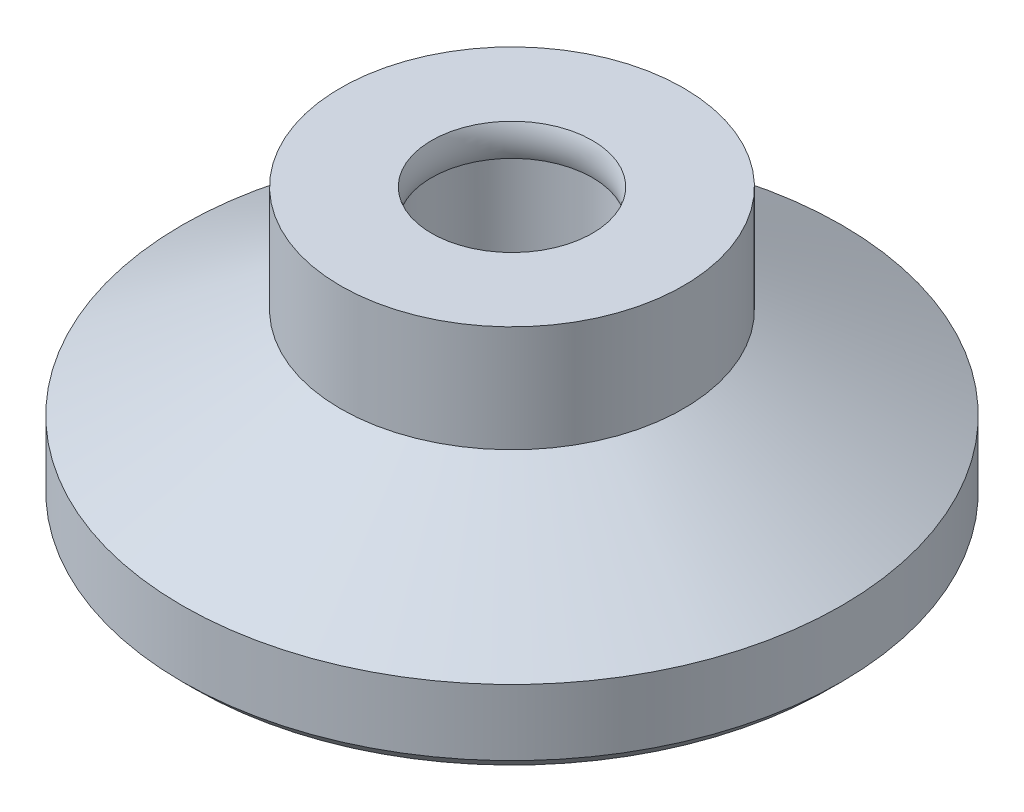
ISO-10303-21;
HEADER;
FILE_DESCRIPTION(('STEP AP214'),'2;1');
FILE_NAME('part.step','',(''),(''),'','','');
FILE_SCHEMA(('AUTOMOTIVE_DESIGN { 1 0 10303 214 1 1 1 1 }'));
ENDSEC;
DATA;
#1=APPLICATION_CONTEXT('core data for automotive mechanical design processes');
#2=APPLICATION_PROTOCOL_DEFINITION('international standard','automotive_design',2000,#1);
#3=PRODUCT_CONTEXT('',#1,'mechanical');
#4=PRODUCT('Part','Part','',(#3));
#5=PRODUCT_RELATED_PRODUCT_CATEGORY('part','',(#4));
#6=PRODUCT_DEFINITION_FORMATION('','',#4);
#7=PRODUCT_DEFINITION_CONTEXT('part definition',#1,'design');
#8=PRODUCT_DEFINITION('design','',#6,#7);
#9=PRODUCT_DEFINITION_SHAPE('','',#8);
#10=(LENGTH_UNIT() NAMED_UNIT(*) SI_UNIT(.MILLI.,.METRE.));
#11=(NAMED_UNIT(*) PLANE_ANGLE_UNIT() SI_UNIT($,.RADIAN.));
#12=(NAMED_UNIT(*) SI_UNIT($,.STERADIAN.) SOLID_ANGLE_UNIT());
#13=UNCERTAINTY_MEASURE_WITH_UNIT(LENGTH_MEASURE(1.E-05),#10,'distance_accuracy_value','');
#14=(GEOMETRIC_REPRESENTATION_CONTEXT(3) GLOBAL_UNCERTAINTY_ASSIGNED_CONTEXT((#13)) GLOBAL_UNIT_ASSIGNED_CONTEXT((#10,
#11,#12)) REPRESENTATION_CONTEXT('',''));
#15=CARTESIAN_POINT('',(0.,0.,0.));
#16=DIRECTION('',(0.,0.,1.));
#17=DIRECTION('',(1.,0.,0.));
#18=AXIS2_PLACEMENT_3D('',#15,#16,#17);
#19=CARTESIAN_POINT('',(0.,5.25,0.));
#20=DIRECTION('',(0.,-1.,0.));
#21=DIRECTION('',(0.,0.,-1.));
#22=AXIS2_PLACEMENT_3D('',#19,#20,#21);
#23=CYLINDRICAL_SURFACE('',#22,6.5);
#24=CARTESIAN_POINT('',(0.,1.21410161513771,0.));
#25=DIRECTION('',(0.,1.,0.));
#26=DIRECTION('',(0.,0.,1.));
#27=AXIS2_PLACEMENT_3D('',#24,#25,#26);
#28=CIRCLE('',#27,6.5);
#29=CARTESIAN_POINT('',(0.,1.21410161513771,-6.5));
#30=VERTEX_POINT('',#29);
#31=EDGE_CURVE('E91',#30,#30,#28,.T.);
#32=CARTESIAN_POINT('',(0.,5.25,0.));
#33=DIRECTION('',(0.,1.,0.));
#34=DIRECTION('',(0.,0.,1.));
#35=AXIS2_PLACEMENT_3D('',#32,#33,#34);
#36=CIRCLE('',#35,6.5);
#37=CARTESIAN_POINT('',(0.,5.25,-6.5));
#38=VERTEX_POINT('',#37);
#39=EDGE_CURVE('E93',#38,#38,#36,.T.);
#40=CARTESIAN_POINT('',(0.,1.21410161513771,-6.5));
#41=CARTESIAN_POINT('',(0.,1.25614222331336,-6.5));
#42=CARTESIAN_POINT('',(0.,1.29818283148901,-6.5));
#43=CARTESIAN_POINT('',(0.,1.3822640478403,-6.5));
#44=CARTESIAN_POINT('',(0.,1.42430465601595,-6.5));
#45=CARTESIAN_POINT('',(0.,1.50838587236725,-6.5));
#46=CARTESIAN_POINT('',(0.,1.5504264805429,-6.5));
#47=CARTESIAN_POINT('',(0.,1.6345076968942,-6.5));
#48=CARTESIAN_POINT('',(0.,1.67654830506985,-6.5));
#49=CARTESIAN_POINT('',(0.,1.76062952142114,-6.5));
#50=CARTESIAN_POINT('',(0.,1.80267012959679,-6.5));
#51=CARTESIAN_POINT('',(0.,1.88675134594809,-6.5));
#52=CARTESIAN_POINT('',(0.,1.92879195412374,-6.5));
#53=CARTESIAN_POINT('',(0.,2.01287317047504,-6.5));
#54=CARTESIAN_POINT('',(0.,2.05491377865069,-6.5));
#55=CARTESIAN_POINT('',(0.,2.13899499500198,-6.5));
#56=CARTESIAN_POINT('',(0.,2.18103560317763,-6.5));
#57=CARTESIAN_POINT('',(0.,2.26511681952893,-6.5));
#58=CARTESIAN_POINT('',(0.,2.30715742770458,-6.5));
#59=CARTESIAN_POINT('',(0.,2.39123864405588,-6.5));
#60=CARTESIAN_POINT('',(0.,2.43327925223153,-6.5));
#61=CARTESIAN_POINT('',(0.,2.51736046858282,-6.5));
#62=CARTESIAN_POINT('',(0.,2.55940107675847,-6.5));
#63=CARTESIAN_POINT('',(0.,2.64348229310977,-6.5));
#64=CARTESIAN_POINT('',(0.,2.68552290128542,-6.5));
#65=CARTESIAN_POINT('',(0.,2.76960411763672,-6.5));
#66=CARTESIAN_POINT('',(0.,2.81164472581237,-6.5));
#67=CARTESIAN_POINT('',(0.,2.89572594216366,-6.5));
#68=CARTESIAN_POINT('',(0.,2.93776655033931,-6.5));
#69=CARTESIAN_POINT('',(0.,3.02184776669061,-6.5));
#70=CARTESIAN_POINT('',(0.,3.06388837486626,-6.5));
#71=CARTESIAN_POINT('',(0.,3.14796959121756,-6.5));
#72=CARTESIAN_POINT('',(0.,3.19001019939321,-6.5));
#73=CARTESIAN_POINT('',(0.,3.2740914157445,-6.5));
#74=CARTESIAN_POINT('',(0.,3.31613202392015,-6.5));
#75=CARTESIAN_POINT('',(0.,3.40021324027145,-6.5));
#76=CARTESIAN_POINT('',(0.,3.4422538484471,-6.5));
#77=CARTESIAN_POINT('',(0.,3.5263350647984,-6.5));
#78=CARTESIAN_POINT('',(0.,3.56837567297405,-6.5));
#79=CARTESIAN_POINT('',(0.,3.65245688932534,-6.5));
#80=CARTESIAN_POINT('',(0.,3.69449749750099,-6.5));
#81=CARTESIAN_POINT('',(0.,3.77857871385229,-6.5));
#82=CARTESIAN_POINT('',(0.,3.82061932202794,-6.5));
#83=CARTESIAN_POINT('',(0.,3.90470053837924,-6.5));
#84=CARTESIAN_POINT('',(0.,3.94674114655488,-6.5));
#85=CARTESIAN_POINT('',(0.,4.03082236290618,-6.5));
#86=CARTESIAN_POINT('',(0.,4.07286297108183,-6.5));
#87=CARTESIAN_POINT('',(0.,4.15694418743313,-6.5));
#88=CARTESIAN_POINT('',(0.,4.19898479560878,-6.5));
#89=CARTESIAN_POINT('',(0.,4.28306601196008,-6.5));
#90=CARTESIAN_POINT('',(0.,4.32510662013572,-6.5));
#91=CARTESIAN_POINT('',(0.,4.40918783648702,-6.5));
#92=CARTESIAN_POINT('',(0.,4.45122844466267,-6.5));
#93=CARTESIAN_POINT('',(0.,4.53530966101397,-6.5));
#94=CARTESIAN_POINT('',(0.,4.57735026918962,-6.5));
#95=CARTESIAN_POINT('',(0.,4.66143148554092,-6.5));
#96=CARTESIAN_POINT('',(0.,4.70347209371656,-6.5));
#97=CARTESIAN_POINT('',(0.,4.78755331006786,-6.5));
#98=CARTESIAN_POINT('',(0.,4.82959391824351,-6.5));
#99=CARTESIAN_POINT('',(0.,4.91367513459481,-6.5));
#100=CARTESIAN_POINT('',(0.,4.95571574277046,-6.5));
#101=CARTESIAN_POINT('',(0.,5.03979695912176,-6.5));
#102=CARTESIAN_POINT('',(0.,5.0818375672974,-6.5));
#103=CARTESIAN_POINT('',(0.,5.1659187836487,-6.5));
#104=CARTESIAN_POINT('',(0.,5.20795939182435,-6.5));
#105=CARTESIAN_POINT('',(0.,5.25,-6.5));
#106=B_SPLINE_CURVE_WITH_KNOTS('',3,(#40,#41,#42,#43,#44,#45,#46,#47,#48,#49,#50,#51,#52,#53,
#54,#55,#56,#57,#58,#59,#60,#61,#62,#63,#64,#65,#66,#67,#68,#69,#70,#71,#72,#73,#74,#75,#76,#77,
#78,#79,#80,#81,#82,#83,#84,#85,#86,#87,#88,#89,#90,#91,#92,#93,#94,#95,#96,#97,#98,#99,#100,
#101,#102,#103,#104,#105),.UNSPECIFIED.,.F.,.F.,(4,2,2,2,2,2,2,2,2,2,2,2,2,2,2,2,2,2,2,2,2,2,2,
2,2,2,2,2,2,2,2,2,4),(0.,0.126121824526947,0.252243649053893,0.378365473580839,
0.504487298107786,0.630609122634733,0.756730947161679,0.882852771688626,1.00897459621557,
1.13509642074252,1.26121824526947,1.38734006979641,1.51346189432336,1.63958371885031,
1.76570554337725,1.8918273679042,2.01794919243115,2.14407101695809,2.27019284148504,
2.39631466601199,2.52243649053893,2.64855831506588,2.77468013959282,2.90080196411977,
3.02692378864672,3.15304561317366,3.27916743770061,3.40528926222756,3.5314110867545,
3.65753291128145,3.7836547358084,3.90977656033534,4.03589838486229),.UNSPECIFIED.);
#107=EDGE_CURVE('BSEAM37',#30,#38,#106,.T.);
#108=ORIENTED_EDGE('',*,*,#31,.T.);
#109=ORIENTED_EDGE('',*,*,#39,.F.);
#110=ORIENTED_EDGE('',*,*,#107,.T.);
#111=ORIENTED_EDGE('',*,*,#107,.F.);
#112=EDGE_LOOP('',(#108,#110,#109,#111));
#113=FACE_BOUND('',#112,.T.);
#114=ADVANCED_FACE('F37',(#113),#23,.T.);
#115=CARTESIAN_POINT('',(0.,5.25,0.));
#116=DIRECTION('',(0.,1.,0.));
#117=DIRECTION('',(0.,0.,1.));
#118=AXIS2_PLACEMENT_3D('',#115,#116,#117);
#119=PLANE('',#118);
#120=CARTESIAN_POINT('',(0.,5.25,0.));
#121=DIRECTION('',(0.,-1.,0.));
#122=DIRECTION('',(0.,0.,-1.));
#123=AXIS2_PLACEMENT_3D('',#120,#121,#122);
#124=CIRCLE('',#123,3.05);
#125=CARTESIAN_POINT('',(0.,5.25,-3.05));
#126=VERTEX_POINT('',#125);
#127=EDGE_CURVE('E113',#126,#126,#124,.T.);
#128=ORIENTED_EDGE('',*,*,#127,.T.);
#129=EDGE_LOOP('',(#128));
#130=FACE_BOUND('',#129,.T.);
#131=ORIENTED_EDGE('',*,*,#39,.T.);
#132=EDGE_LOOP('',(#131));
#133=FACE_BOUND('',#132,.T.);
#134=ADVANCED_FACE('F65',(#130,#133),#119,.T.);
#135=CARTESIAN_POINT('',(0.,1.21410161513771,0.));
#136=DIRECTION('',(0.,-1.,0.));
#137=DIRECTION('',(0.,0.,-1.));
#138=AXIS2_PLACEMENT_3D('',#135,#136,#137);
#139=CONICAL_SURFACE('',#138,6.5,1.0471975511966);
#140=CARTESIAN_POINT('',(0.,-2.25,0.));
#141=DIRECTION('',(0.,1.,0.));
#142=DIRECTION('',(0.,0.,1.));
#143=AXIS2_PLACEMENT_3D('',#140,#141,#142);
#144=CIRCLE('',#143,12.5);
#145=CARTESIAN_POINT('',(0.,-2.25,12.5));
#146=VERTEX_POINT('',#145);
#147=EDGE_CURVE('E89',#146,#146,#144,.T.);
#148=ORIENTED_EDGE('',*,*,#147,.T.);
#149=EDGE_LOOP('',(#148));
#150=FACE_BOUND('',#149,.T.);
#151=ORIENTED_EDGE('',*,*,#31,.F.);
#152=EDGE_LOOP('',(#151));
#153=FACE_BOUND('',#152,.T.);
#154=ADVANCED_FACE('F70',(#150,#153),#139,.T.);
#155=CARTESIAN_POINT('',(0.,-5.25,0.));
#156=DIRECTION('',(0.,1.,0.));
#157=DIRECTION('',(0.,0.,1.));
#158=AXIS2_PLACEMENT_3D('',#155,#156,#157);
#159=PLANE('',#158);
#160=CARTESIAN_POINT('',(0.,-5.25,0.));
#161=DIRECTION('',(0.,1.,0.));
#162=DIRECTION('',(0.,0.,1.));
#163=AXIS2_PLACEMENT_3D('',#160,#161,#162);
#164=CIRCLE('',#163,12.);
#165=CARTESIAN_POINT('',(0.,-5.25,12.));
#166=VERTEX_POINT('',#165);
#167=EDGE_CURVE('E45',#166,#166,#164,.F.);
#168=ORIENTED_EDGE('',*,*,#167,.T.);
#169=EDGE_LOOP('',(#168));
#170=FACE_BOUND('',#169,.T.);
#171=ADVANCED_FACE('F76',(#170),#159,.F.);
#172=CARTESIAN_POINT('',(0.,-2.25,0.));
#173=DIRECTION('',(0.,-1.,0.));
#174=DIRECTION('',(0.,0.,-1.));
#175=AXIS2_PLACEMENT_3D('',#172,#173,#174);
#176=CYLINDRICAL_SURFACE('',#175,12.5);
#177=CARTESIAN_POINT('',(0.,-4.75,0.));
#178=DIRECTION('',(0.,1.,0.));
#179=DIRECTION('',(0.,0.,1.));
#180=AXIS2_PLACEMENT_3D('',#177,#178,#179);
#181=CIRCLE('',#180,12.5);
#182=CARTESIAN_POINT('',(0.,-4.75,12.5));
#183=VERTEX_POINT('',#182);
#184=EDGE_CURVE('E11',#183,#183,#181,.T.);
#185=ORIENTED_EDGE('',*,*,#184,.T.);
#186=EDGE_LOOP('',(#185));
#187=FACE_BOUND('',#186,.T.);
#188=ORIENTED_EDGE('',*,*,#147,.F.);
#189=EDGE_LOOP('',(#188));
#190=FACE_BOUND('',#189,.T.);
#191=ADVANCED_FACE('F60',(#187,#190),#176,.T.);
#192=CARTESIAN_POINT('',(0.,-5.25,0.));
#193=DIRECTION('',(0.,1.,0.));
#194=DIRECTION('',(0.,0.,1.));
#195=AXIS2_PLACEMENT_3D('',#192,#193,#194);
#196=CONICAL_SURFACE('',#195,12.,0.785398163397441);
#197=ORIENTED_EDGE('',*,*,#184,.F.);
#198=EDGE_LOOP('',(#197));
#199=FACE_BOUND('',#198,.T.);
#200=ORIENTED_EDGE('',*,*,#167,.F.);
#201=EDGE_LOOP('',(#200));
#202=FACE_BOUND('',#201,.T.);
#203=ADVANCED_FACE('F39',(#199,#202),#196,.T.);
#204=CARTESIAN_POINT('',(0.,-2.25,0.));
#205=DIRECTION('',(0.,1.,0.));
#206=DIRECTION('',(0.,0.,1.));
#207=AXIS2_PLACEMENT_3D('',#204,#205,#206);
#208=CONICAL_SURFACE('',#207,0.,1.04719755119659);
#209=CARTESIAN_POINT('',(0.,-0.489081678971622,0.));
#210=DIRECTION('',(0.,-1.,0.));
#211=DIRECTION('',(0.,0.,-1.));
#212=AXIS2_PLACEMENT_3D('',#209,#210,#211);
#213=CIRCLE('',#212,3.05);
#214=CARTESIAN_POINT('',(0.,-0.489081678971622,-3.05));
#215=VERTEX_POINT('',#214);
#216=EDGE_CURVE('E101',#215,#215,#213,.T.);
#217=ORIENTED_EDGE('',*,*,#216,.F.);
#218=EDGE_LOOP('',(#217));
#219=FACE_BOUND('',#218,.T.);
#220=CARTESIAN_POINT('',(0.,-2.25,0.));
#221=VERTEX_POINT('',#220);
#222=VERTEX_LOOP('',#221);
#223=FACE_BOUND('',#222,.T.);
#224=ADVANCED_FACE('F48',(#219,#223),#208,.F.);
#225=CARTESIAN_POINT('',(0.,0.,0.));
#226=DIRECTION('',(0.,-1.,0.));
#227=DIRECTION('',(0.,0.,-1.));
#228=AXIS2_PLACEMENT_3D('',#225,#226,#227);
#229=CYLINDRICAL_SURFACE('',#228,3.05);
#230=CARTESIAN_POINT('',(0.,4.03,0.));
#231=DIRECTION('',(0.,-1.,0.));
#232=DIRECTION('',(0.,0.,-1.));
#233=AXIS2_PLACEMENT_3D('',#230,#231,#232);
#234=CIRCLE('',#233,3.05);
#235=CARTESIAN_POINT('',(0.,4.03,-3.05));
#236=VERTEX_POINT('',#235);
#237=EDGE_CURVE('E109',#236,#236,#234,.T.);
#238=ORIENTED_EDGE('',*,*,#237,.F.);
#239=EDGE_LOOP('',(#238));
#240=FACE_BOUND('',#239,.T.);
#241=ORIENTED_EDGE('',*,*,#216,.T.);
#242=EDGE_LOOP('',(#241));
#243=FACE_BOUND('',#242,.T.);
#244=ADVANCED_FACE('F50',(#240,#243),#229,.F.);
#245=CARTESIAN_POINT('',(0.,4.64,0.));
#246=DIRECTION('',(0.,-1.,0.));
#247=DIRECTION('',(0.,0.,-1.));
#248=AXIS2_PLACEMENT_3D('',#245,#246,#247);
#249=TOROIDAL_SURFACE('',#248,4.51399999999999,1.586);
#250=ORIENTED_EDGE('',*,*,#127,.F.);
#251=EDGE_LOOP('',(#250));
#252=FACE_BOUND('',#251,.T.);
#253=ORIENTED_EDGE('',*,*,#237,.T.);
#254=EDGE_LOOP('',(#253));
#255=FACE_BOUND('',#254,.T.);
#256=ADVANCED_FACE('F57',(#252,#255),#249,.T.);
#257=CLOSED_SHELL('',(#114,#134,#154,#171,#191,#203,#224,#244,#256));
#258=MANIFOLD_SOLID_BREP('B2',#257);
#259=ADVANCED_BREP_SHAPE_REPRESENTATION('',(#18,#258),#14);
#260=SHAPE_DEFINITION_REPRESENTATION(#9,#259);
ENDSEC;
END-ISO-10303-21;
